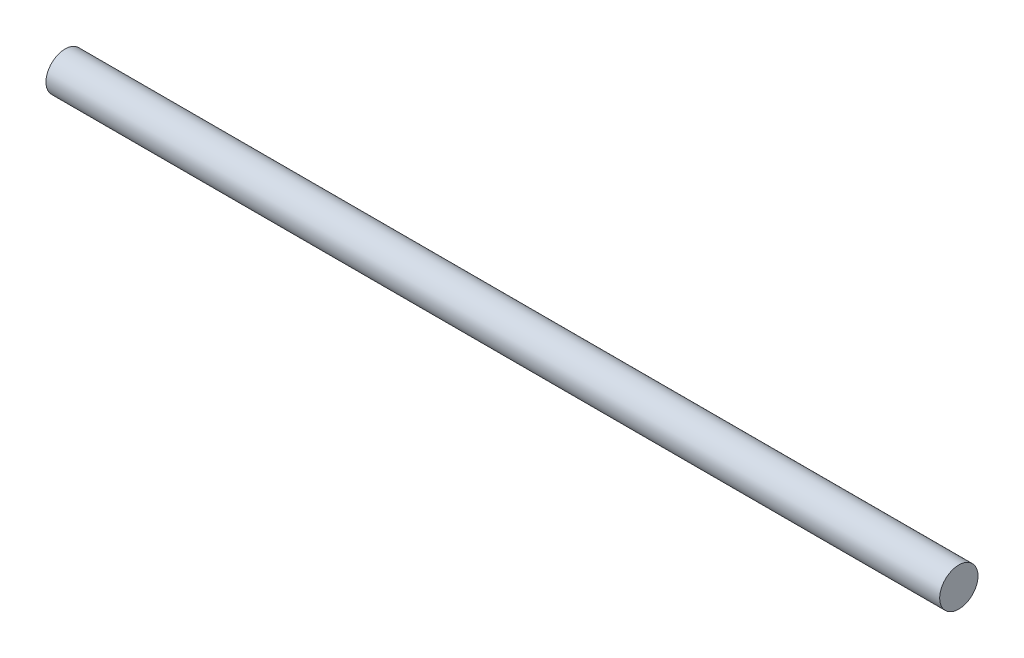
from build123d import *

# Parameters (mm, degrees)
SKETCH1_R           = 3
BOSS_EXTRUDE1_DEPTH = 140


with BuildPart() as part:
    # Sketch1 → Boss-Extrude1 (new body)
    with BuildSketch(Plane(origin=(0, 0, 0), x_dir=(0, 0, -1), z_dir=(1, 0, 0))):
        Circle(SKETCH1_R)
    extrude(amount=BOSS_EXTRUDE1_DEPTH)


solid = part.part
